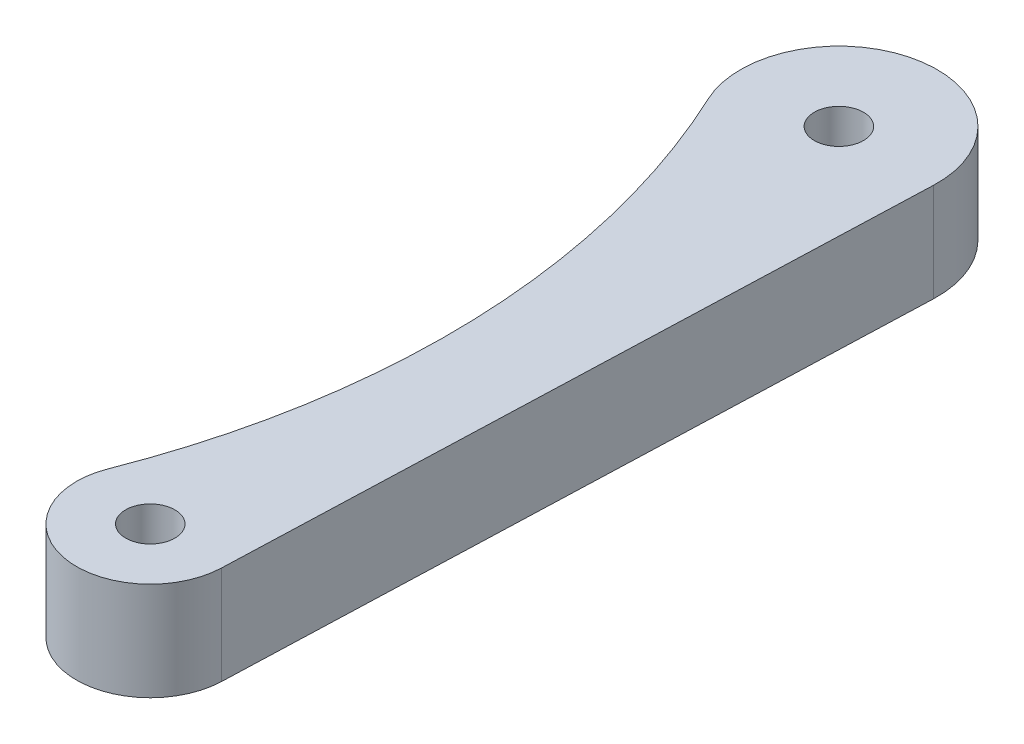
ISO-10303-21;
HEADER;
FILE_DESCRIPTION(('STEP AP214'),'2;1');
FILE_NAME('part.step','',(''),(''),'','','');
FILE_SCHEMA(('AUTOMOTIVE_DESIGN { 1 0 10303 214 1 1 1 1 }'));
ENDSEC;
DATA;
#1=APPLICATION_CONTEXT('core data for automotive mechanical design processes');
#2=APPLICATION_PROTOCOL_DEFINITION('international standard','automotive_design',2000,#1);
#3=PRODUCT_CONTEXT('',#1,'mechanical');
#4=PRODUCT('Part','Part','',(#3));
#5=PRODUCT_RELATED_PRODUCT_CATEGORY('part','',(#4));
#6=PRODUCT_DEFINITION_FORMATION('','',#4);
#7=PRODUCT_DEFINITION_CONTEXT('part definition',#1,'design');
#8=PRODUCT_DEFINITION('design','',#6,#7);
#9=PRODUCT_DEFINITION_SHAPE('','',#8);
#10=(LENGTH_UNIT() NAMED_UNIT(*) SI_UNIT(.MILLI.,.METRE.));
#11=(NAMED_UNIT(*) PLANE_ANGLE_UNIT() SI_UNIT($,.RADIAN.));
#12=(NAMED_UNIT(*) SI_UNIT($,.STERADIAN.) SOLID_ANGLE_UNIT());
#13=UNCERTAINTY_MEASURE_WITH_UNIT(LENGTH_MEASURE(1.E-05),#10,'distance_accuracy_value','');
#14=(GEOMETRIC_REPRESENTATION_CONTEXT(3) GLOBAL_UNCERTAINTY_ASSIGNED_CONTEXT((#13)) GLOBAL_UNIT_ASSIGNED_CONTEXT((#10,
#11,#12)) REPRESENTATION_CONTEXT('',''));
#15=CARTESIAN_POINT('',(0.,0.,0.));
#16=DIRECTION('',(0.,0.,1.));
#17=DIRECTION('',(1.,0.,0.));
#18=AXIS2_PLACEMENT_3D('',#15,#16,#17);
#19=CARTESIAN_POINT('',(0.,10.,-70.));
#20=DIRECTION('',(0.,1.,0.));
#21=DIRECTION('',(0.,0.,1.));
#22=AXIS2_PLACEMENT_3D('',#19,#20,#21);
#23=PLANE('',#22);
#24=CARTESIAN_POINT('',(0.,10.,-70.));
#25=DIRECTION('',(0.,1.,0.));
#26=DIRECTION('',(0.,0.,1.));
#27=AXIS2_PLACEMENT_3D('',#24,#25,#26);
#28=CIRCLE('',#27,2.5);
#29=CARTESIAN_POINT('',(0.,10.,-67.5));
#30=VERTEX_POINT('',#29);
#31=EDGE_CURVE('E100',#30,#30,#28,.T.);
#32=ORIENTED_EDGE('',*,*,#31,.F.);
#33=EDGE_LOOP('',(#32));
#34=FACE_BOUND('',#33,.T.);
#35=CARTESIAN_POINT('',(0.,10.,-70.));
#36=DIRECTION('',(0.,1.,0.));
#37=DIRECTION('',(0.,0.,1.));
#38=AXIS2_PLACEMENT_3D('',#35,#36,#37);
#39=CIRCLE('',#38,10.);
#40=CARTESIAN_POINT('',(9.99362041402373,10.,-69.6428571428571));
#41=VERTEX_POINT('',#40);
#42=CARTESIAN_POINT('',(-9.05612020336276,10.,-65.7589285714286));
#43=VERTEX_POINT('',#42);
#44=EDGE_CURVE('E51',#41,#43,#39,.T.);
#45=ORIENTED_EDGE('',*,*,#44,.T.);
#46=CARTESIAN_POINT('',(-81.5050818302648,10.,-31.8303571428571));
#47=DIRECTION('',(0.,-1.,0.));
#48=DIRECTION('',(0.,0.,-1.));
#49=AXIS2_PLACEMENT_3D('',#46,#47,#48);
#50=CIRCLE('',#49,80.);
#51=CARTESIAN_POINT('',(-6.98614987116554,10.,-2.72831632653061));
#52=VERTEX_POINT('',#51);
#53=EDGE_CURVE('E82',#43,#52,#50,.T.);
#54=ORIENTED_EDGE('',*,*,#53,.T.);
#55=CARTESIAN_POINT('',(5.29090660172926E-13,10.,1.38777878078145E-13));
#56=DIRECTION('',(0.,1.,0.));
#57=DIRECTION('',(0.,0.,-1.));
#58=AXIS2_PLACEMENT_3D('',#55,#56,#57);
#59=CIRCLE('',#58,7.50000000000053);
#60=CARTESIAN_POINT('',(7.4952153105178,10.,0.267857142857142));
#61=VERTEX_POINT('',#60);
#62=EDGE_CURVE('E86',#52,#61,#59,.T.);
#63=ORIENTED_EDGE('',*,*,#62,.T.);
#64=DIRECTION('',(0.0357142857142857,0.,-0.999362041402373));
#65=VECTOR('',#64,1.);
#66=CARTESIAN_POINT('',(9.99362041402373,10.,-69.6428571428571));
#67=LINE('',#66,#65);
#68=EDGE_CURVE('E93',#61,#41,#67,.T.);
#69=ORIENTED_EDGE('',*,*,#68,.T.);
#70=EDGE_LOOP('',(#45,#54,#63,#69));
#71=FACE_BOUND('',#70,.T.);
#72=CARTESIAN_POINT('',(0.,10.,0.));
#73=DIRECTION('',(0.,1.,0.));
#74=DIRECTION('',(0.,0.,1.));
#75=AXIS2_PLACEMENT_3D('',#72,#73,#74);
#76=CIRCLE('',#75,2.5);
#77=CARTESIAN_POINT('',(0.,10.,2.5));
#78=VERTEX_POINT('',#77);
#79=EDGE_CURVE('E139',#78,#78,#76,.T.);
#80=ORIENTED_EDGE('',*,*,#79,.F.);
#81=EDGE_LOOP('',(#80));
#82=FACE_BOUND('',#81,.T.);
#83=ADVANCED_FACE('F34',(#34,#71,#82),#23,.T.);
#84=CARTESIAN_POINT('',(0.,0.,-70.));
#85=DIRECTION('',(0.,1.,0.));
#86=DIRECTION('',(0.,0.,1.));
#87=AXIS2_PLACEMENT_3D('',#84,#85,#86);
#88=PLANE('',#87);
#89=CARTESIAN_POINT('',(-81.5050818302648,0.,-31.8303571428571));
#90=DIRECTION('',(0.,-1.,0.));
#91=DIRECTION('',(0.,0.,-1.));
#92=AXIS2_PLACEMENT_3D('',#89,#90,#91);
#93=CIRCLE('',#92,80.);
#94=CARTESIAN_POINT('',(-9.05612020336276,0.,-65.7589285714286));
#95=VERTEX_POINT('',#94);
#96=CARTESIAN_POINT('',(-6.98614987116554,0.,-2.72831632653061));
#97=VERTEX_POINT('',#96);
#98=EDGE_CURVE('E89',#95,#97,#93,.T.);
#99=ORIENTED_EDGE('',*,*,#98,.F.);
#100=CARTESIAN_POINT('',(0.,0.,-70.));
#101=DIRECTION('',(0.,1.,0.));
#102=DIRECTION('',(0.,0.,1.));
#103=AXIS2_PLACEMENT_3D('',#100,#101,#102);
#104=CIRCLE('',#103,10.);
#105=CARTESIAN_POINT('',(9.99362041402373,0.,-69.6428571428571));
#106=VERTEX_POINT('',#105);
#107=EDGE_CURVE('E75',#106,#95,#104,.T.);
#108=ORIENTED_EDGE('',*,*,#107,.F.);
#109=DIRECTION('',(0.0357142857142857,0.,-0.999362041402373));
#110=VECTOR('',#109,1.);
#111=CARTESIAN_POINT('',(9.99362041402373,0.,-69.6428571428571));
#112=LINE('',#111,#110);
#113=CARTESIAN_POINT('',(7.4952153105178,0.,0.267857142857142));
#114=VERTEX_POINT('',#113);
#115=EDGE_CURVE('E102',#114,#106,#112,.T.);
#116=ORIENTED_EDGE('',*,*,#115,.F.);
#117=CARTESIAN_POINT('',(0.,0.,0.));
#118=DIRECTION('',(0.,1.,0.));
#119=DIRECTION('',(0.,0.,1.));
#120=AXIS2_PLACEMENT_3D('',#117,#118,#119);
#121=CIRCLE('',#120,7.5);
#122=EDGE_CURVE('E68',#97,#114,#121,.T.);
#123=ORIENTED_EDGE('',*,*,#122,.F.);
#124=EDGE_LOOP('',(#99,#108,#116,#123));
#125=FACE_BOUND('',#124,.T.);
#126=CARTESIAN_POINT('',(0.,0.,-70.));
#127=DIRECTION('',(0.,1.,0.));
#128=DIRECTION('',(0.,0.,1.));
#129=AXIS2_PLACEMENT_3D('',#126,#127,#128);
#130=CIRCLE('',#129,2.5);
#131=CARTESIAN_POINT('',(0.,0.,-67.5));
#132=VERTEX_POINT('',#131);
#133=EDGE_CURVE('E145',#132,#132,#130,.T.);
#134=ORIENTED_EDGE('',*,*,#133,.T.);
#135=EDGE_LOOP('',(#134));
#136=FACE_BOUND('',#135,.T.);
#137=CARTESIAN_POINT('',(0.,0.,0.));
#138=DIRECTION('',(0.,1.,0.));
#139=DIRECTION('',(0.,0.,1.));
#140=AXIS2_PLACEMENT_3D('',#137,#138,#139);
#141=CIRCLE('',#140,2.5);
#142=CARTESIAN_POINT('',(0.,0.,2.5));
#143=VERTEX_POINT('',#142);
#144=EDGE_CURVE('E142',#143,#143,#141,.T.);
#145=ORIENTED_EDGE('',*,*,#144,.T.);
#146=EDGE_LOOP('',(#145));
#147=FACE_BOUND('',#146,.T.);
#148=ADVANCED_FACE('F109',(#125,#136,#147),#88,.F.);
#149=CARTESIAN_POINT('',(-81.5050818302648,10.,-31.8303571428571));
#150=DIRECTION('',(0.,-1.,0.));
#151=DIRECTION('',(0.,0.,-1.));
#152=AXIS2_PLACEMENT_3D('',#149,#150,#151);
#153=CYLINDRICAL_SURFACE('',#152,80.);
#154=ORIENTED_EDGE('',*,*,#98,.T.);
#155=DIRECTION('',(0.,-1.,0.));
#156=VECTOR('',#155,1.);
#157=CARTESIAN_POINT('',(-6.98614987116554,10.,-2.72831632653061));
#158=LINE('',#157,#156);
#159=EDGE_CURVE('E43',#52,#97,#158,.T.);
#160=ORIENTED_EDGE('',*,*,#159,.F.);
#161=ORIENTED_EDGE('',*,*,#53,.F.);
#162=DIRECTION('',(0.,-1.,0.));
#163=VECTOR('',#162,1.);
#164=CARTESIAN_POINT('',(-9.05612020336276,10.,-65.7589285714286));
#165=LINE('',#164,#163);
#166=EDGE_CURVE('E11',#43,#95,#165,.T.);
#167=ORIENTED_EDGE('',*,*,#166,.T.);
#168=EDGE_LOOP('',(#154,#160,#161,#167));
#169=FACE_BOUND('',#168,.T.);
#170=ADVANCED_FACE('F36',(#169),#153,.F.);
#171=CARTESIAN_POINT('',(0.,10.,0.));
#172=DIRECTION('',(0.,-1.,0.));
#173=DIRECTION('',(0.,0.,-1.));
#174=AXIS2_PLACEMENT_3D('',#171,#172,#173);
#175=CYLINDRICAL_SURFACE('',#174,7.5);
#176=ORIENTED_EDGE('',*,*,#122,.T.);
#177=DIRECTION('',(0.,-1.,0.));
#178=VECTOR('',#177,1.);
#179=CARTESIAN_POINT('',(7.4952153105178,10.,0.267857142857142));
#180=LINE('',#179,#178);
#181=EDGE_CURVE('E90',#61,#114,#180,.T.);
#182=ORIENTED_EDGE('',*,*,#181,.F.);
#183=ORIENTED_EDGE('',*,*,#62,.F.);
#184=ORIENTED_EDGE('',*,*,#159,.T.);
#185=EDGE_LOOP('',(#176,#182,#183,#184));
#186=FACE_BOUND('',#185,.T.);
#187=ADVANCED_FACE('F91',(#186),#175,.T.);
#188=CARTESIAN_POINT('',(9.99362041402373,10.,-69.6428571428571));
#189=DIRECTION('',(-0.999362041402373,0.,-0.0357142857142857));
#190=DIRECTION('',(-0.0357142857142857,0.,0.999362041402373));
#191=AXIS2_PLACEMENT_3D('',#188,#189,#190);
#192=PLANE('',#191);
#193=ORIENTED_EDGE('',*,*,#115,.T.);
#194=DIRECTION('',(0.,-1.,0.));
#195=VECTOR('',#194,1.);
#196=CARTESIAN_POINT('',(9.99362041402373,10.,-69.6428571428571));
#197=LINE('',#196,#195);
#198=EDGE_CURVE('E95',#41,#106,#197,.T.);
#199=ORIENTED_EDGE('',*,*,#198,.F.);
#200=ORIENTED_EDGE('',*,*,#68,.F.);
#201=ORIENTED_EDGE('',*,*,#181,.T.);
#202=EDGE_LOOP('',(#193,#199,#200,#201));
#203=FACE_BOUND('',#202,.T.);
#204=ADVANCED_FACE('F107',(#203),#192,.F.);
#205=CARTESIAN_POINT('',(0.,10.,-70.));
#206=DIRECTION('',(0.,-1.,0.));
#207=DIRECTION('',(0.,0.,-1.));
#208=AXIS2_PLACEMENT_3D('',#205,#206,#207);
#209=CYLINDRICAL_SURFACE('',#208,10.);
#210=ORIENTED_EDGE('',*,*,#107,.T.);
#211=ORIENTED_EDGE('',*,*,#166,.F.);
#212=ORIENTED_EDGE('',*,*,#44,.F.);
#213=ORIENTED_EDGE('',*,*,#198,.T.);
#214=EDGE_LOOP('',(#210,#211,#212,#213));
#215=FACE_BOUND('',#214,.T.);
#216=ADVANCED_FACE('F111',(#215),#209,.T.);
#217=CARTESIAN_POINT('',(0.,10.,-70.));
#218=DIRECTION('',(0.,-1.,0.));
#219=DIRECTION('',(0.,0.,-1.));
#220=AXIS2_PLACEMENT_3D('',#217,#218,#219);
#221=CYLINDRICAL_SURFACE('',#220,2.5);
#222=ORIENTED_EDGE('',*,*,#31,.T.);
#223=EDGE_LOOP('',(#222));
#224=FACE_BOUND('',#223,.T.);
#225=ORIENTED_EDGE('',*,*,#133,.F.);
#226=EDGE_LOOP('',(#225));
#227=FACE_BOUND('',#226,.T.);
#228=ADVANCED_FACE('F113',(#224,#227),#221,.F.);
#229=CARTESIAN_POINT('',(0.,10.,0.));
#230=DIRECTION('',(0.,-1.,0.));
#231=DIRECTION('',(0.,0.,-1.));
#232=AXIS2_PLACEMENT_3D('',#229,#230,#231);
#233=CYLINDRICAL_SURFACE('',#232,2.5);
#234=ORIENTED_EDGE('',*,*,#79,.T.);
#235=EDGE_LOOP('',(#234));
#236=FACE_BOUND('',#235,.T.);
#237=ORIENTED_EDGE('',*,*,#144,.F.);
#238=EDGE_LOOP('',(#237));
#239=FACE_BOUND('',#238,.T.);
#240=ADVANCED_FACE('F119',(#236,#239),#233,.F.);
#241=CLOSED_SHELL('',(#83,#148,#170,#187,#204,#216,#228,#240));
#242=MANIFOLD_SOLID_BREP('B2',#241);
#243=ADVANCED_BREP_SHAPE_REPRESENTATION('',(#18,#242),#14);
#244=SHAPE_DEFINITION_REPRESENTATION(#9,#243);
ENDSEC;
END-ISO-10303-21;
